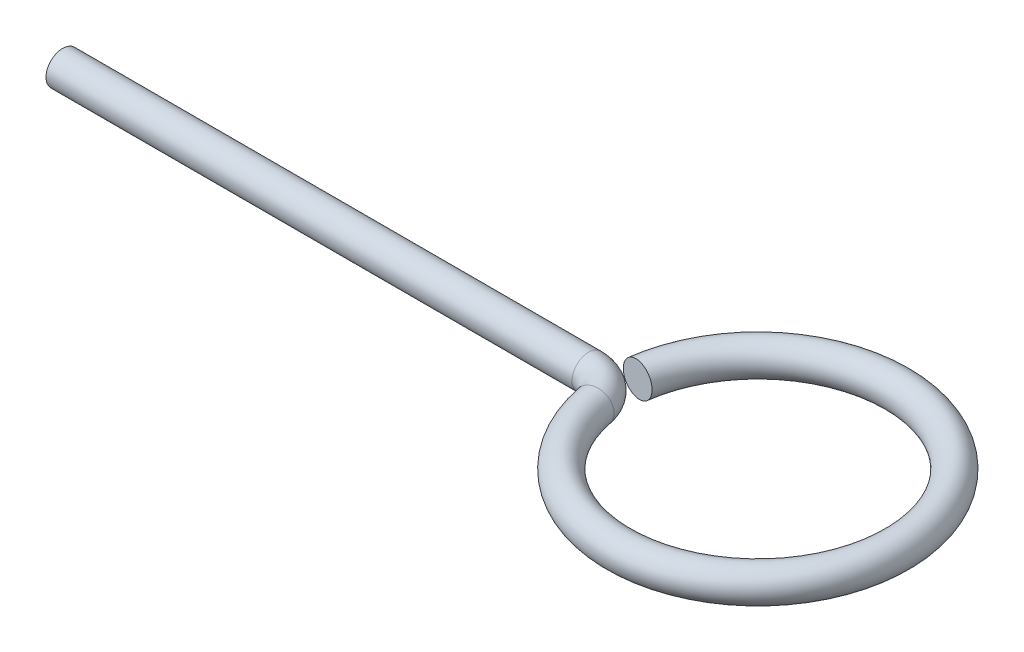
ISO-10303-21;
HEADER;
FILE_DESCRIPTION(('STEP AP214'),'2;1');
FILE_NAME('part.step','',(''),(''),'','','');
FILE_SCHEMA(('AUTOMOTIVE_DESIGN { 1 0 10303 214 1 1 1 1 }'));
ENDSEC;
DATA;
#1=APPLICATION_CONTEXT('core data for automotive mechanical design processes');
#2=APPLICATION_PROTOCOL_DEFINITION('international standard','automotive_design',2000,#1);
#3=PRODUCT_CONTEXT('',#1,'mechanical');
#4=PRODUCT('Part','Part','',(#3));
#5=PRODUCT_RELATED_PRODUCT_CATEGORY('part','',(#4));
#6=PRODUCT_DEFINITION_FORMATION('','',#4);
#7=PRODUCT_DEFINITION_CONTEXT('part definition',#1,'design');
#8=PRODUCT_DEFINITION('design','',#6,#7);
#9=PRODUCT_DEFINITION_SHAPE('','',#8);
#10=(LENGTH_UNIT() NAMED_UNIT(*) SI_UNIT(.MILLI.,.METRE.));
#11=(NAMED_UNIT(*) PLANE_ANGLE_UNIT() SI_UNIT($,.RADIAN.));
#12=(NAMED_UNIT(*) SI_UNIT($,.STERADIAN.) SOLID_ANGLE_UNIT());
#13=UNCERTAINTY_MEASURE_WITH_UNIT(LENGTH_MEASURE(1.E-05),#10,'distance_accuracy_value','');
#14=(GEOMETRIC_REPRESENTATION_CONTEXT(3) GLOBAL_UNCERTAINTY_ASSIGNED_CONTEXT((#13)) GLOBAL_UNIT_ASSIGNED_CONTEXT((#10,
#11,#12)) REPRESENTATION_CONTEXT('',''));
#15=CARTESIAN_POINT('',(0.,0.,0.));
#16=DIRECTION('',(0.,0.,1.));
#17=DIRECTION('',(1.,0.,0.));
#18=AXIS2_PLACEMENT_3D('',#15,#16,#17);
#19=CARTESIAN_POINT('',(62.5,0.,0.));
#20=DIRECTION('',(0.,1.,0.));
#21=DIRECTION('',(0.,0.,1.));
#22=AXIS2_PLACEMENT_3D('',#19,#20,#21);
#23=TOROIDAL_SURFACE('',#22,12.5,1.5);
#24=CARTESIAN_POINT('',(50.2363658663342,0.,2.41935483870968));
#25=DIRECTION('',(0.193548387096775,0.,0.981090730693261));
#26=DIRECTION('',(0.981090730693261,0.,-0.193548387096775));
#27=AXIS2_PLACEMENT_3D('',#24,#25,#26);
#28=CIRCLE('',#27,1.5);
#29=CARTESIAN_POINT('',(48.7647297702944,0.,2.70967741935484));
#30=VERTEX_POINT('',#29);
#31=EDGE_CURVE('E38',#30,#30,#28,.T.);
#32=CARTESIAN_POINT('',(50.1024,0.,-1.59671983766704));
#33=DIRECTION('',(-0.127737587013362,0.,0.991808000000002));
#34=DIRECTION('',(0.991808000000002,0.,0.127737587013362));
#35=AXIS2_PLACEMENT_3D('',#32,#33,#34);
#36=CIRCLE('',#35,1.5);
#37=CARTESIAN_POINT('',(48.614688,0.,-1.78832621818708));
#38=VERTEX_POINT('',#37);
#39=EDGE_CURVE('E10',#38,#38,#36,.T.);
#40=CARTESIAN_POINT('',(62.5,0.,0.));
#41=DIRECTION('',(0.,1.,0.));
#42=DIRECTION('',(0.,0.,1.));
#43=AXIS2_PLACEMENT_3D('',#40,#41,#42);
#44=CIRCLE('',#43,14.);
#45=EDGE_CURVE('',#30,#38,#44,.T.);
#46=ORIENTED_EDGE('',*,*,#31,.T.);
#47=ORIENTED_EDGE('',*,*,#39,.F.);
#48=ORIENTED_EDGE('',*,*,#45,.T.);
#49=ORIENTED_EDGE('',*,*,#45,.F.);
#50=EDGE_LOOP('',(#46,#48,#47,#49));
#51=FACE_BOUND('',#50,.T.);
#52=ADVANCED_FACE('F32',(#51),#23,.T.);
#53=CARTESIAN_POINT('',(47.2930936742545,0.,3.));
#54=DIRECTION('',(0.,-1.,0.));
#55=DIRECTION('',(0.,0.,-1.));
#56=AXIS2_PLACEMENT_3D('',#53,#54,#55);
#57=TOROIDAL_SURFACE('',#56,3.,1.5);
#58=CARTESIAN_POINT('',(47.2930936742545,0.,0.));
#59=DIRECTION('',(1.,0.,0.));
#60=DIRECTION('',(0.,0.,-1.));
#61=AXIS2_PLACEMENT_3D('',#58,#59,#60);
#62=CIRCLE('',#61,1.5);
#63=CARTESIAN_POINT('',(47.2930936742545,0.,1.5));
#64=VERTEX_POINT('',#63);
#65=EDGE_CURVE('E42',#64,#64,#62,.T.);
#66=ORIENTED_EDGE('',*,*,#65,.T.);
#67=EDGE_LOOP('',(#66));
#68=FACE_BOUND('',#67,.T.);
#69=ORIENTED_EDGE('',*,*,#31,.F.);
#70=EDGE_LOOP('',(#69));
#71=FACE_BOUND('',#70,.T.);
#72=ADVANCED_FACE('F63',(#68,#71),#57,.T.);
#73=CARTESIAN_POINT('',(47.2930936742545,0.,0.));
#74=DIRECTION('',(-1.,0.,0.));
#75=DIRECTION('',(0.,0.,1.));
#76=AXIS2_PLACEMENT_3D('',#73,#74,#75);
#77=CYLINDRICAL_SURFACE('',#76,1.5);
#78=CARTESIAN_POINT('',(0.,0.,0.));
#79=DIRECTION('',(1.,0.,0.));
#80=DIRECTION('',(0.,0.,-1.));
#81=AXIS2_PLACEMENT_3D('',#78,#79,#80);
#82=CIRCLE('',#81,1.5);
#83=CARTESIAN_POINT('',(0.,0.,1.5));
#84=VERTEX_POINT('',#83);
#85=EDGE_CURVE('E46',#84,#84,#82,.T.);
#86=CARTESIAN_POINT('',(47.2930936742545,0.,1.5));
#87=CARTESIAN_POINT('',(46.8004572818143,0.,1.5));
#88=CARTESIAN_POINT('',(46.3078208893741,0.,1.5));
#89=CARTESIAN_POINT('',(45.3225481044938,0.,1.5));
#90=CARTESIAN_POINT('',(44.8299117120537,0.,1.5));
#91=CARTESIAN_POINT('',(43.8446389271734,0.,1.5));
#92=CARTESIAN_POINT('',(43.3520025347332,0.,1.5));
#93=CARTESIAN_POINT('',(42.3667297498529,0.,1.5));
#94=CARTESIAN_POINT('',(41.8740933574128,0.,1.5));
#95=CARTESIAN_POINT('',(40.8888205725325,0.,1.5));
#96=CARTESIAN_POINT('',(40.3961841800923,0.,1.5));
#97=CARTESIAN_POINT('',(39.410911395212,0.,1.5));
#98=CARTESIAN_POINT('',(38.9182750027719,0.,1.5));
#99=CARTESIAN_POINT('',(37.9330022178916,0.,1.5));
#100=CARTESIAN_POINT('',(37.4403658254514,0.,1.5));
#101=CARTESIAN_POINT('',(36.4550930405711,0.,1.5));
#102=CARTESIAN_POINT('',(35.962456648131,0.,1.5));
#103=CARTESIAN_POINT('',(34.9771838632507,0.,1.5));
#104=CARTESIAN_POINT('',(34.4845474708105,0.,1.5));
#105=CARTESIAN_POINT('',(33.4992746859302,0.,1.5));
#106=CARTESIAN_POINT('',(33.0066382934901,0.,1.5));
#107=CARTESIAN_POINT('',(32.0213655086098,0.,1.5));
#108=CARTESIAN_POINT('',(31.5287291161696,0.,1.5));
#109=CARTESIAN_POINT('',(30.5434563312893,0.,1.5));
#110=CARTESIAN_POINT('',(30.0508199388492,0.,1.5));
#111=CARTESIAN_POINT('',(29.0655471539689,0.,1.5));
#112=CARTESIAN_POINT('',(28.5729107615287,0.,1.5));
#113=CARTESIAN_POINT('',(27.5876379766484,0.,1.5));
#114=CARTESIAN_POINT('',(27.0950015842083,0.,1.5));
#115=CARTESIAN_POINT('',(26.109728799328,0.,1.5));
#116=CARTESIAN_POINT('',(25.6170924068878,0.,1.5));
#117=CARTESIAN_POINT('',(24.6318196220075,0.,1.5));
#118=CARTESIAN_POINT('',(24.1391832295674,0.,1.5));
#119=CARTESIAN_POINT('',(23.1539104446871,0.,1.5));
#120=CARTESIAN_POINT('',(22.6612740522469,0.,1.5));
#121=CARTESIAN_POINT('',(21.6760012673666,0.,1.5));
#122=CARTESIAN_POINT('',(21.1833648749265,0.,1.5));
#123=CARTESIAN_POINT('',(20.1980920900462,0.,1.5));
#124=CARTESIAN_POINT('',(19.705455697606,0.,1.5));
#125=CARTESIAN_POINT('',(18.7201829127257,0.,1.5));
#126=CARTESIAN_POINT('',(18.2275465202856,0.,1.5));
#127=CARTESIAN_POINT('',(17.2422737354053,0.,1.5));
#128=CARTESIAN_POINT('',(16.7496373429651,0.,1.5));
#129=CARTESIAN_POINT('',(15.7643645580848,0.,1.5));
#130=CARTESIAN_POINT('',(15.2717281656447,0.,1.5));
#131=CARTESIAN_POINT('',(14.2864553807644,0.,1.5));
#132=CARTESIAN_POINT('',(13.7938189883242,0.,1.5));
#133=CARTESIAN_POINT('',(12.8085462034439,0.,1.5));
#134=CARTESIAN_POINT('',(12.3159098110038,0.,1.5));
#135=CARTESIAN_POINT('',(11.3306370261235,0.,1.5));
#136=CARTESIAN_POINT('',(10.8380006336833,0.,1.5));
#137=CARTESIAN_POINT('',(9.85272784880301,0.,1.5));
#138=CARTESIAN_POINT('',(9.36009145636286,0.,1.5));
#139=CARTESIAN_POINT('',(8.37481867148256,0.,1.5));
#140=CARTESIAN_POINT('',(7.88218227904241,0.,1.5));
#141=CARTESIAN_POINT('',(6.89690949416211,0.,1.5));
#142=CARTESIAN_POINT('',(6.40427310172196,0.,1.5));
#143=CARTESIAN_POINT('',(5.41900031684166,0.,1.5));
#144=CARTESIAN_POINT('',(4.9263639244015,0.,1.5));
#145=CARTESIAN_POINT('',(3.94109113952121,0.,1.5));
#146=CARTESIAN_POINT('',(3.44845474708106,0.,1.5));
#147=CARTESIAN_POINT('',(2.46318196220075,0.,1.5));
#148=CARTESIAN_POINT('',(1.9705455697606,0.,1.5));
#149=CARTESIAN_POINT('',(0.9852727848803,0.,1.5));
#150=CARTESIAN_POINT('',(0.492636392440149,0.,1.5));
#151=CARTESIAN_POINT('',(0.,0.,1.5));
#152=B_SPLINE_CURVE_WITH_KNOTS('',3,(#86,#87,#88,#89,#90,#91,#92,#93,#94,#95,#96,#97,#98,#99,
#100,#101,#102,#103,#104,#105,#106,#107,#108,#109,#110,#111,#112,#113,#114,#115,#116,#117,#118,
#119,#120,#121,#122,#123,#124,#125,#126,#127,#128,#129,#130,#131,#132,#133,#134,#135,#136,#137,
#138,#139,#140,#141,#142,#143,#144,#145,#146,#147,#148,#149,#150,#151),.UNSPECIFIED.,.F.,.F.,(4,
2,2,2,2,2,2,2,2,2,2,2,2,2,2,2,2,2,2,2,2,2,2,2,2,2,2,2,2,2,2,2,4),(0.,1.47790917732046,
2.95581835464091,4.43372753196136,5.91163670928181,7.38954588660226,8.86745506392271,
10.3453642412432,11.8232734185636,13.3011825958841,14.7790917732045,16.257000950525,
17.7349101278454,19.2128193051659,20.6907284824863,22.1686376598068,23.6465468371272,
25.1244560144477,26.6023651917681,28.0802743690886,29.558183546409,31.0360927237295,
32.5140019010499,33.9919110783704,35.4698202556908,36.9477294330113,38.4256386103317,
39.9035477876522,41.3814569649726,42.8593661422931,44.3372753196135,45.815184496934,
47.2930936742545),.UNSPECIFIED.);
#153=EDGE_CURVE('BSEAM52',#64,#84,#152,.T.);
#154=ORIENTED_EDGE('',*,*,#65,.F.);
#155=ORIENTED_EDGE('',*,*,#85,.T.);
#156=ORIENTED_EDGE('',*,*,#153,.T.);
#157=ORIENTED_EDGE('',*,*,#153,.F.);
#158=EDGE_LOOP('',(#154,#156,#155,#157));
#159=FACE_BOUND('',#158,.T.);
#160=ADVANCED_FACE('F52',(#159),#77,.T.);
#161=CARTESIAN_POINT('',(50.1024,0.,-1.59671983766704));
#162=DIRECTION('',(-0.127737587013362,0.,0.991808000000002));
#163=DIRECTION('',(0.991808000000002,0.,0.127737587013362));
#164=AXIS2_PLACEMENT_3D('',#161,#162,#163);
#165=PLANE('',#164);
#166=ORIENTED_EDGE('',*,*,#39,.T.);
#167=EDGE_LOOP('',(#166));
#168=FACE_BOUND('',#167,.T.);
#169=ADVANCED_FACE('F56',(#168),#165,.T.);
#170=CARTESIAN_POINT('',(0.,0.,0.));
#171=DIRECTION('',(1.,0.,0.));
#172=DIRECTION('',(0.,0.,-1.));
#173=AXIS2_PLACEMENT_3D('',#170,#171,#172);
#174=PLANE('',#173);
#175=ORIENTED_EDGE('',*,*,#85,.F.);
#176=EDGE_LOOP('',(#175));
#177=FACE_BOUND('',#176,.T.);
#178=ADVANCED_FACE('F54',(#177),#174,.F.);
#179=CLOSED_SHELL('',(#52,#72,#160,#169,#178));
#180=MANIFOLD_SOLID_BREP('B2',#179);
#181=ADVANCED_BREP_SHAPE_REPRESENTATION('',(#18,#180),#14);
#182=SHAPE_DEFINITION_REPRESENTATION(#9,#181);
ENDSEC;
END-ISO-10303-21;
